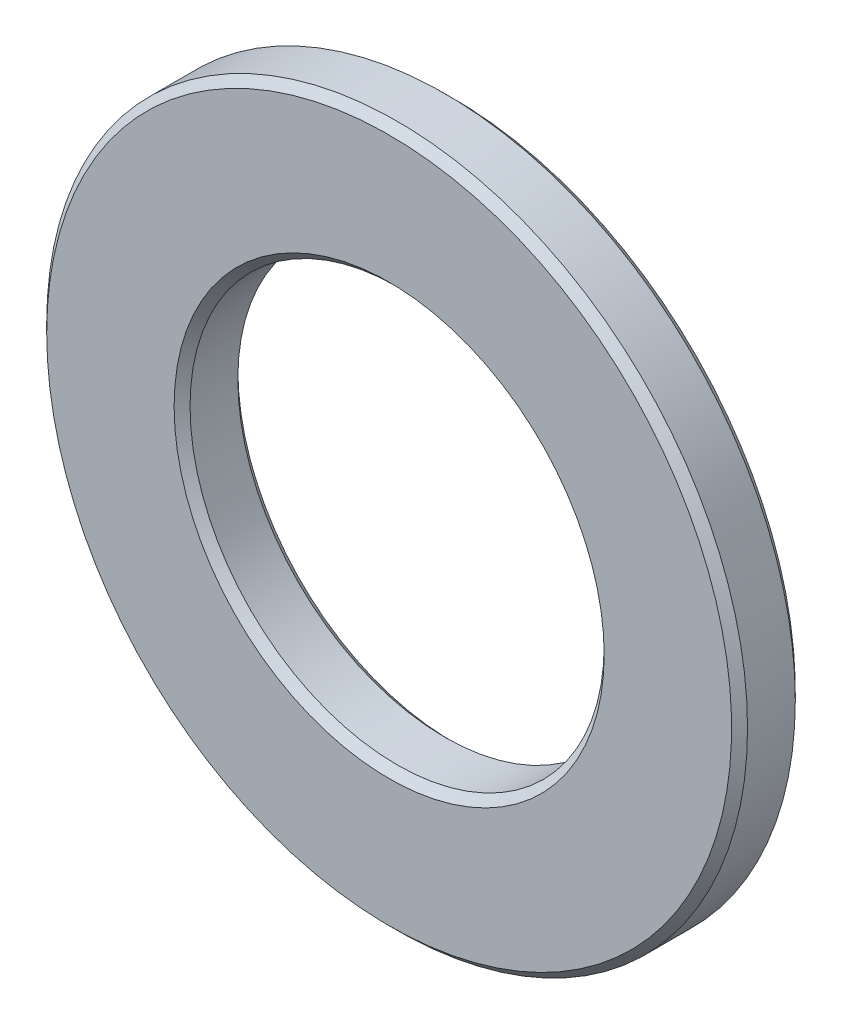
ISO-10303-21;
HEADER;
FILE_DESCRIPTION(('STEP AP214'),'2;1');
FILE_NAME('part.step','',(''),(''),'','','');
FILE_SCHEMA(('AUTOMOTIVE_DESIGN { 1 0 10303 214 1 1 1 1 }'));
ENDSEC;
DATA;
#1=APPLICATION_CONTEXT('core data for automotive mechanical design processes');
#2=APPLICATION_PROTOCOL_DEFINITION('international standard','automotive_design',2000,#1);
#3=PRODUCT_CONTEXT('',#1,'mechanical');
#4=PRODUCT('Part','Part','',(#3));
#5=PRODUCT_RELATED_PRODUCT_CATEGORY('part','',(#4));
#6=PRODUCT_DEFINITION_FORMATION('','',#4);
#7=PRODUCT_DEFINITION_CONTEXT('part definition',#1,'design');
#8=PRODUCT_DEFINITION('design','',#6,#7);
#9=PRODUCT_DEFINITION_SHAPE('','',#8);
#10=(LENGTH_UNIT() NAMED_UNIT(*) SI_UNIT(.MILLI.,.METRE.));
#11=(NAMED_UNIT(*) PLANE_ANGLE_UNIT() SI_UNIT($,.RADIAN.));
#12=(NAMED_UNIT(*) SI_UNIT($,.STERADIAN.) SOLID_ANGLE_UNIT());
#13=UNCERTAINTY_MEASURE_WITH_UNIT(LENGTH_MEASURE(1.E-05),#10,'distance_accuracy_value','');
#14=(GEOMETRIC_REPRESENTATION_CONTEXT(3) GLOBAL_UNCERTAINTY_ASSIGNED_CONTEXT((#13)) GLOBAL_UNIT_ASSIGNED_CONTEXT((#10,
#11,#12)) REPRESENTATION_CONTEXT('',''));
#15=CARTESIAN_POINT('',(0.,0.,0.));
#16=DIRECTION('',(0.,0.,1.));
#17=DIRECTION('',(1.,0.,0.));
#18=AXIS2_PLACEMENT_3D('',#15,#16,#17);
#19=CARTESIAN_POINT('',(0.,0.,-4.));
#20=DIRECTION('',(0.,0.,1.));
#21=DIRECTION('',(1.,0.,0.));
#22=AXIS2_PLACEMENT_3D('',#19,#20,#21);
#23=PLANE('',#22);
#24=CARTESIAN_POINT('',(0.,0.,-4.));
#25=DIRECTION('',(0.,0.,-1.));
#26=DIRECTION('',(-1.,0.,0.));
#27=AXIS2_PLACEMENT_3D('',#24,#25,#26);
#28=CIRCLE('',#27,21.5);
#29=CARTESIAN_POINT('',(-21.5,0.,-4.));
#30=VERTEX_POINT('',#29);
#31=EDGE_CURVE('E10',#30,#30,#28,.T.);
#32=ORIENTED_EDGE('',*,*,#31,.T.);
#33=EDGE_LOOP('',(#32));
#34=FACE_BOUND('',#33,.T.);
#35=CARTESIAN_POINT('',(0.,0.,-4.));
#36=DIRECTION('',(0.,0.,-1.));
#37=DIRECTION('',(-1.,0.,0.));
#38=AXIS2_PLACEMENT_3D('',#35,#36,#37);
#39=CIRCLE('',#38,13.5);
#40=CARTESIAN_POINT('',(-13.5,0.,-4.));
#41=VERTEX_POINT('',#40);
#42=EDGE_CURVE('E62',#41,#41,#39,.T.);
#43=ORIENTED_EDGE('',*,*,#42,.F.);
#44=EDGE_LOOP('',(#43));
#45=FACE_BOUND('',#44,.T.);
#46=ADVANCED_FACE('F38',(#34,#45),#23,.F.);
#47=CARTESIAN_POINT('',(21.5,0.,0.));
#48=DIRECTION('',(0.,0.,-1.));
#49=DIRECTION('',(-1.,0.,0.));
#50=AXIS2_PLACEMENT_3D('',#47,#48,#49);
#51=PLANE('',#50);
#52=CARTESIAN_POINT('',(0.,0.,0.));
#53=DIRECTION('',(0.,0.,-1.));
#54=DIRECTION('',(-1.,0.,0.));
#55=AXIS2_PLACEMENT_3D('',#52,#53,#54);
#56=CIRCLE('',#55,21.5);
#57=CARTESIAN_POINT('',(-21.5,0.,0.));
#58=VERTEX_POINT('',#57);
#59=EDGE_CURVE('E56',#58,#58,#56,.T.);
#60=ORIENTED_EDGE('',*,*,#59,.F.);
#61=EDGE_LOOP('',(#60));
#62=FACE_BOUND('',#61,.T.);
#63=CARTESIAN_POINT('',(0.,0.,0.));
#64=DIRECTION('',(0.,0.,-1.));
#65=DIRECTION('',(-1.,0.,0.));
#66=AXIS2_PLACEMENT_3D('',#63,#64,#65);
#67=CIRCLE('',#66,13.5);
#68=CARTESIAN_POINT('',(-13.5,0.,0.));
#69=VERTEX_POINT('',#68);
#70=EDGE_CURVE('E74',#69,#69,#67,.T.);
#71=ORIENTED_EDGE('',*,*,#70,.T.);
#72=EDGE_LOOP('',(#71));
#73=FACE_BOUND('',#72,.T.);
#74=ADVANCED_FACE('F78',(#62,#73),#51,.F.);
#75=CARTESIAN_POINT('',(0.,0.,-3.5));
#76=DIRECTION('',(0.,0.,1.));
#77=DIRECTION('',(1.,0.,0.));
#78=AXIS2_PLACEMENT_3D('',#75,#76,#77);
#79=CONICAL_SURFACE('',#78,22.,0.785398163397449);
#80=ORIENTED_EDGE('',*,*,#31,.F.);
#81=EDGE_LOOP('',(#80));
#82=FACE_BOUND('',#81,.T.);
#83=CARTESIAN_POINT('',(0.,0.,-3.5));
#84=DIRECTION('',(0.,0.,-1.));
#85=DIRECTION('',(-1.,0.,0.));
#86=AXIS2_PLACEMENT_3D('',#83,#84,#85);
#87=CIRCLE('',#86,22.);
#88=CARTESIAN_POINT('',(-22.,0.,-3.5));
#89=VERTEX_POINT('',#88);
#90=EDGE_CURVE('E45',#89,#89,#87,.T.);
#91=ORIENTED_EDGE('',*,*,#90,.T.);
#92=EDGE_LOOP('',(#91));
#93=FACE_BOUND('',#92,.T.);
#94=ADVANCED_FACE('F95',(#82,#93),#79,.T.);
#95=CARTESIAN_POINT('',(0.,0.,0.));
#96=DIRECTION('',(0.,0.,-1.));
#97=DIRECTION('',(-1.,0.,0.));
#98=AXIS2_PLACEMENT_3D('',#95,#96,#97);
#99=CYLINDRICAL_SURFACE('',#98,22.);
#100=ORIENTED_EDGE('',*,*,#90,.F.);
#101=EDGE_LOOP('',(#100));
#102=FACE_BOUND('',#101,.T.);
#103=CARTESIAN_POINT('',(0.,0.,-0.5));
#104=DIRECTION('',(0.,0.,-1.));
#105=DIRECTION('',(-1.,0.,0.));
#106=AXIS2_PLACEMENT_3D('',#103,#104,#105);
#107=CIRCLE('',#106,22.);
#108=CARTESIAN_POINT('',(-22.,0.,-0.5));
#109=VERTEX_POINT('',#108);
#110=EDGE_CURVE('E51',#109,#109,#107,.T.);
#111=ORIENTED_EDGE('',*,*,#110,.T.);
#112=EDGE_LOOP('',(#111));
#113=FACE_BOUND('',#112,.T.);
#114=ADVANCED_FACE('F111',(#102,#113),#99,.T.);
#115=CARTESIAN_POINT('',(0.,0.,0.));
#116=DIRECTION('',(0.,0.,-1.));
#117=DIRECTION('',(-1.,0.,0.));
#118=AXIS2_PLACEMENT_3D('',#115,#116,#117);
#119=CONICAL_SURFACE('',#118,21.5,0.785398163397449);
#120=ORIENTED_EDGE('',*,*,#110,.F.);
#121=EDGE_LOOP('',(#120));
#122=FACE_BOUND('',#121,.T.);
#123=ORIENTED_EDGE('',*,*,#59,.T.);
#124=EDGE_LOOP('',(#123));
#125=FACE_BOUND('',#124,.T.);
#126=ADVANCED_FACE('F103',(#122,#125),#119,.T.);
#127=CARTESIAN_POINT('',(0.,0.,-3.5));
#128=DIRECTION('',(0.,0.,-1.));
#129=DIRECTION('',(-1.,0.,0.));
#130=AXIS2_PLACEMENT_3D('',#127,#128,#129);
#131=CONICAL_SURFACE('',#130,13.,0.785398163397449);
#132=ORIENTED_EDGE('',*,*,#42,.T.);
#133=EDGE_LOOP('',(#132));
#134=FACE_BOUND('',#133,.T.);
#135=CARTESIAN_POINT('',(0.,0.,-3.5));
#136=DIRECTION('',(0.,0.,-1.));
#137=DIRECTION('',(-1.,0.,0.));
#138=AXIS2_PLACEMENT_3D('',#135,#136,#137);
#139=CIRCLE('',#138,13.);
#140=CARTESIAN_POINT('',(-13.,0.,-3.5));
#141=VERTEX_POINT('',#140);
#142=EDGE_CURVE('E66',#141,#141,#139,.T.);
#143=ORIENTED_EDGE('',*,*,#142,.F.);
#144=EDGE_LOOP('',(#143));
#145=FACE_BOUND('',#144,.T.);
#146=ADVANCED_FACE('F88',(#134,#145),#131,.F.);
#147=CARTESIAN_POINT('',(0.,0.,0.));
#148=DIRECTION('',(0.,0.,-1.));
#149=DIRECTION('',(-1.,0.,0.));
#150=AXIS2_PLACEMENT_3D('',#147,#148,#149);
#151=CYLINDRICAL_SURFACE('',#150,13.);
#152=ORIENTED_EDGE('',*,*,#142,.T.);
#153=EDGE_LOOP('',(#152));
#154=FACE_BOUND('',#153,.T.);
#155=CARTESIAN_POINT('',(0.,0.,-0.5));
#156=DIRECTION('',(0.,0.,-1.));
#157=DIRECTION('',(-1.,0.,0.));
#158=AXIS2_PLACEMENT_3D('',#155,#156,#157);
#159=CIRCLE('',#158,13.);
#160=CARTESIAN_POINT('',(-13.,0.,-0.5));
#161=VERTEX_POINT('',#160);
#162=EDGE_CURVE('E70',#161,#161,#159,.T.);
#163=ORIENTED_EDGE('',*,*,#162,.F.);
#164=EDGE_LOOP('',(#163));
#165=FACE_BOUND('',#164,.T.);
#166=ADVANCED_FACE('F82',(#154,#165),#151,.F.);
#167=CARTESIAN_POINT('',(0.,0.,0.));
#168=DIRECTION('',(0.,0.,1.));
#169=DIRECTION('',(1.,0.,0.));
#170=AXIS2_PLACEMENT_3D('',#167,#168,#169);
#171=CONICAL_SURFACE('',#170,13.5,0.785398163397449);
#172=ORIENTED_EDGE('',*,*,#162,.T.);
#173=EDGE_LOOP('',(#172));
#174=FACE_BOUND('',#173,.T.);
#175=ORIENTED_EDGE('',*,*,#70,.F.);
#176=EDGE_LOOP('',(#175));
#177=FACE_BOUND('',#176,.T.);
#178=ADVANCED_FACE('F80',(#174,#177),#171,.F.);
#179=CLOSED_SHELL('',(#46,#74,#94,#114,#126,#146,#166,#178));
#180=MANIFOLD_SOLID_BREP('B2',#179);
#181=ADVANCED_BREP_SHAPE_REPRESENTATION('',(#18,#180),#14);
#182=SHAPE_DEFINITION_REPRESENTATION(#9,#181);
ENDSEC;
END-ISO-10303-21;
